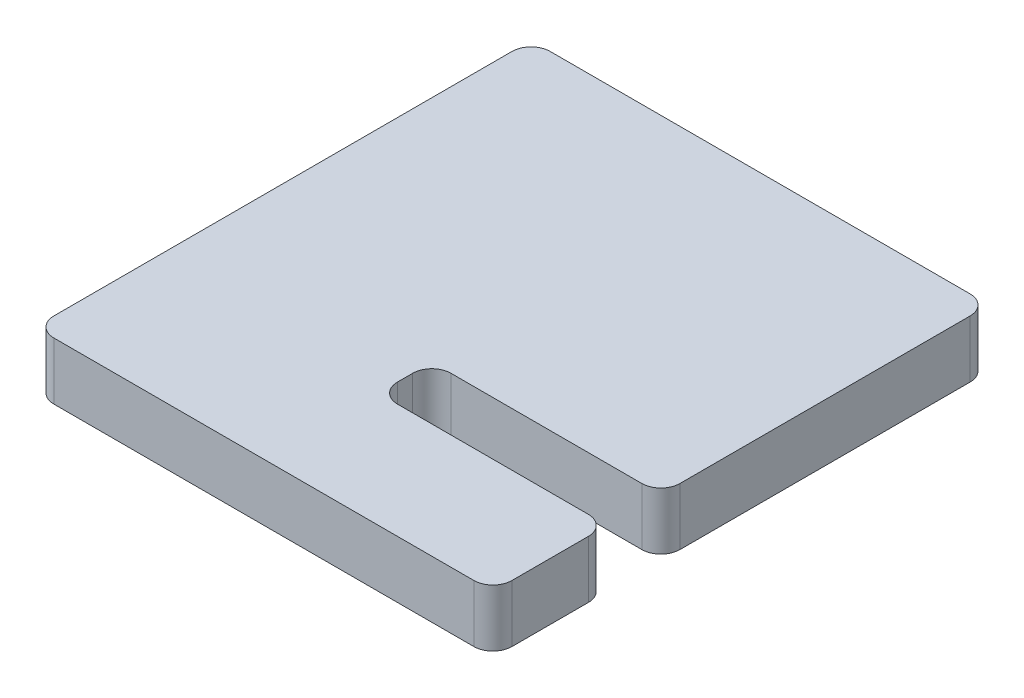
ISO-10303-21;
HEADER;
FILE_DESCRIPTION(('STEP AP214'),'2;1');
FILE_NAME('part.step','',(''),(''),'','','');
FILE_SCHEMA(('AUTOMOTIVE_DESIGN { 1 0 10303 214 1 1 1 1 }'));
ENDSEC;
DATA;
#1=APPLICATION_CONTEXT('core data for automotive mechanical design processes');
#2=APPLICATION_PROTOCOL_DEFINITION('international standard','automotive_design',2000,#1);
#3=PRODUCT_CONTEXT('',#1,'mechanical');
#4=PRODUCT('Part','Part','',(#3));
#5=PRODUCT_RELATED_PRODUCT_CATEGORY('part','',(#4));
#6=PRODUCT_DEFINITION_FORMATION('','',#4);
#7=PRODUCT_DEFINITION_CONTEXT('part definition',#1,'design');
#8=PRODUCT_DEFINITION('design','',#6,#7);
#9=PRODUCT_DEFINITION_SHAPE('','',#8);
#10=(LENGTH_UNIT() NAMED_UNIT(*) SI_UNIT(.MILLI.,.METRE.));
#11=(NAMED_UNIT(*) PLANE_ANGLE_UNIT() SI_UNIT($,.RADIAN.));
#12=(NAMED_UNIT(*) SI_UNIT($,.STERADIAN.) SOLID_ANGLE_UNIT());
#13=UNCERTAINTY_MEASURE_WITH_UNIT(LENGTH_MEASURE(1.E-05),#10,'distance_accuracy_value','');
#14=(GEOMETRIC_REPRESENTATION_CONTEXT(3) GLOBAL_UNCERTAINTY_ASSIGNED_CONTEXT((#13)) GLOBAL_UNIT_ASSIGNED_CONTEXT((#10,
#11,#12)) REPRESENTATION_CONTEXT('',''));
#15=CARTESIAN_POINT('',(0.,0.,0.));
#16=DIRECTION('',(0.,0.,1.));
#17=DIRECTION('',(1.,0.,0.));
#18=AXIS2_PLACEMENT_3D('',#15,#16,#17);
#19=CARTESIAN_POINT('',(-12.,3.,-13.));
#20=DIRECTION('',(1.,0.,0.));
#21=DIRECTION('',(0.,0.,-1.));
#22=AXIS2_PLACEMENT_3D('',#19,#20,#21);
#23=PLANE('',#22);
#24=DIRECTION('',(0.,0.,1.));
#25=VECTOR('',#24,1.);
#26=CARTESIAN_POINT('',(-12.,3.,-13.));
#27=LINE('',#26,#25);
#28=CARTESIAN_POINT('',(-12.,3.,-12.));
#29=VERTEX_POINT('',#28);
#30=CARTESIAN_POINT('',(-12.,3.,12.));
#31=VERTEX_POINT('',#30);
#32=EDGE_CURVE('E166',#29,#31,#27,.T.);
#33=ORIENTED_EDGE('',*,*,#32,.F.);
#34=DIRECTION('',(0.,-1.,0.));
#35=VECTOR('',#34,1.);
#36=CARTESIAN_POINT('',(-12.,3.,-12.));
#37=LINE('',#36,#35);
#38=CARTESIAN_POINT('',(-12.,0.,-12.));
#39=VERTEX_POINT('',#38);
#40=EDGE_CURVE('E151',#29,#39,#37,.T.);
#41=ORIENTED_EDGE('',*,*,#40,.T.);
#42=DIRECTION('',(0.,0.,1.));
#43=VECTOR('',#42,1.);
#44=CARTESIAN_POINT('',(-12.,0.,-13.));
#45=LINE('',#44,#43);
#46=CARTESIAN_POINT('',(-12.,0.,12.));
#47=VERTEX_POINT('',#46);
#48=EDGE_CURVE('E163',#39,#47,#45,.T.);
#49=ORIENTED_EDGE('',*,*,#48,.T.);
#50=DIRECTION('',(0.,-1.,0.));
#51=VECTOR('',#50,1.);
#52=CARTESIAN_POINT('',(-12.,3.,12.));
#53=LINE('',#52,#51);
#54=EDGE_CURVE('E168',#47,#31,#53,.F.);
#55=ORIENTED_EDGE('',*,*,#54,.T.);
#56=EDGE_LOOP('',(#33,#41,#49,#55));
#57=FACE_BOUND('',#56,.T.);
#58=ADVANCED_FACE('F33',(#57),#23,.F.);
#59=CARTESIAN_POINT('',(12.,3.,13.));
#60=DIRECTION('',(0.,0.,-1.));
#61=DIRECTION('',(-1.,0.,0.));
#62=AXIS2_PLACEMENT_3D('',#59,#60,#61);
#63=PLANE('',#62);
#64=DIRECTION('',(1.,0.,0.));
#65=VECTOR('',#64,1.);
#66=CARTESIAN_POINT('',(12.,3.,13.));
#67=LINE('',#66,#65);
#68=CARTESIAN_POINT('',(-11.,3.,13.));
#69=VERTEX_POINT('',#68);
#70=CARTESIAN_POINT('',(11.,3.,13.));
#71=VERTEX_POINT('',#70);
#72=EDGE_CURVE('E380',#69,#71,#67,.T.);
#73=ORIENTED_EDGE('',*,*,#72,.F.);
#74=DIRECTION('',(0.,-1.,0.));
#75=VECTOR('',#74,1.);
#76=CARTESIAN_POINT('',(-11.,3.,13.));
#77=LINE('',#76,#75);
#78=CARTESIAN_POINT('',(-11.,0.,13.));
#79=VERTEX_POINT('',#78);
#80=EDGE_CURVE('E245',#69,#79,#77,.T.);
#81=ORIENTED_EDGE('',*,*,#80,.T.);
#82=DIRECTION('',(1.,0.,0.));
#83=VECTOR('',#82,1.);
#84=CARTESIAN_POINT('',(12.,0.,13.));
#85=LINE('',#84,#83);
#86=CARTESIAN_POINT('',(11.,0.,13.));
#87=VERTEX_POINT('',#86);
#88=EDGE_CURVE('E173',#79,#87,#85,.T.);
#89=ORIENTED_EDGE('',*,*,#88,.T.);
#90=DIRECTION('',(0.,-1.,0.));
#91=VECTOR('',#90,1.);
#92=CARTESIAN_POINT('',(11.,3.,13.));
#93=LINE('',#92,#91);
#94=EDGE_CURVE('E243',#87,#71,#93,.F.);
#95=ORIENTED_EDGE('',*,*,#94,.T.);
#96=EDGE_LOOP('',(#73,#81,#89,#95));
#97=FACE_BOUND('',#96,.T.);
#98=ADVANCED_FACE('F310',(#97),#63,.F.);
#99=CARTESIAN_POINT('',(12.,3.,7.));
#100=DIRECTION('',(-1.,0.,0.));
#101=DIRECTION('',(0.,0.,1.));
#102=AXIS2_PLACEMENT_3D('',#99,#100,#101);
#103=PLANE('',#102);
#104=DIRECTION('',(0.,0.,-1.));
#105=VECTOR('',#104,1.);
#106=CARTESIAN_POINT('',(12.,0.,7.));
#107=LINE('',#106,#105);
#108=CARTESIAN_POINT('',(12.,0.,12.));
#109=VERTEX_POINT('',#108);
#110=CARTESIAN_POINT('',(12.,0.,8.));
#111=VERTEX_POINT('',#110);
#112=EDGE_CURVE('E176',#109,#111,#107,.T.);
#113=ORIENTED_EDGE('',*,*,#112,.T.);
#114=DIRECTION('',(0.,-1.,0.));
#115=VECTOR('',#114,1.);
#116=CARTESIAN_POINT('',(12.,3.,8.));
#117=LINE('',#116,#115);
#118=CARTESIAN_POINT('',(12.,3.,8.));
#119=VERTEX_POINT('',#118);
#120=EDGE_CURVE('E241',#111,#119,#117,.F.);
#121=ORIENTED_EDGE('',*,*,#120,.T.);
#122=DIRECTION('',(0.,0.,-1.));
#123=VECTOR('',#122,1.);
#124=CARTESIAN_POINT('',(12.,3.,7.));
#125=LINE('',#124,#123);
#126=CARTESIAN_POINT('',(12.,3.,12.));
#127=VERTEX_POINT('',#126);
#128=EDGE_CURVE('E277',#127,#119,#125,.T.);
#129=ORIENTED_EDGE('',*,*,#128,.F.);
#130=DIRECTION('',(0.,-1.,0.));
#131=VECTOR('',#130,1.);
#132=CARTESIAN_POINT('',(12.,3.,12.));
#133=LINE('',#132,#131);
#134=EDGE_CURVE('E238',#127,#109,#133,.T.);
#135=ORIENTED_EDGE('',*,*,#134,.T.);
#136=EDGE_LOOP('',(#113,#121,#129,#135));
#137=FACE_BOUND('',#136,.T.);
#138=ADVANCED_FACE('F315',(#137),#103,.F.);
#139=CARTESIAN_POINT('',(0.,3.,7.));
#140=DIRECTION('',(0.,0.,1.));
#141=DIRECTION('',(1.,0.,0.));
#142=AXIS2_PLACEMENT_3D('',#139,#140,#141);
#143=PLANE('',#142);
#144=DIRECTION('',(-1.,0.,0.));
#145=VECTOR('',#144,1.);
#146=CARTESIAN_POINT('',(0.,0.,7.));
#147=LINE('',#146,#145);
#148=CARTESIAN_POINT('',(11.,0.,7.));
#149=VERTEX_POINT('',#148);
#150=CARTESIAN_POINT('',(1.,0.,7.));
#151=VERTEX_POINT('',#150);
#152=EDGE_CURVE('E184',#149,#151,#147,.T.);
#153=ORIENTED_EDGE('',*,*,#152,.T.);
#154=DIRECTION('',(0.,-1.,0.));
#155=VECTOR('',#154,1.);
#156=CARTESIAN_POINT('',(1.,3.,7.));
#157=LINE('',#156,#155);
#158=CARTESIAN_POINT('',(1.,3.,7.));
#159=VERTEX_POINT('',#158);
#160=EDGE_CURVE('E236',#151,#159,#157,.F.);
#161=ORIENTED_EDGE('',*,*,#160,.T.);
#162=DIRECTION('',(-1.,0.,0.));
#163=VECTOR('',#162,1.);
#164=CARTESIAN_POINT('',(0.,3.,7.));
#165=LINE('',#164,#163);
#166=CARTESIAN_POINT('',(11.,3.,7.));
#167=VERTEX_POINT('',#166);
#168=EDGE_CURVE('E269',#167,#159,#165,.T.);
#169=ORIENTED_EDGE('',*,*,#168,.F.);
#170=DIRECTION('',(0.,-1.,0.));
#171=VECTOR('',#170,1.);
#172=CARTESIAN_POINT('',(11.,3.,7.));
#173=LINE('',#172,#171);
#174=EDGE_CURVE('E233',#167,#149,#173,.T.);
#175=ORIENTED_EDGE('',*,*,#174,.T.);
#176=EDGE_LOOP('',(#153,#161,#169,#175));
#177=FACE_BOUND('',#176,.T.);
#178=ADVANCED_FACE('F257',(#177),#143,.F.);
#179=CARTESIAN_POINT('',(0.,3.,7.));
#180=DIRECTION('',(-1.,0.,0.));
#181=DIRECTION('',(0.,0.,1.));
#182=AXIS2_PLACEMENT_3D('',#179,#180,#181);
#183=PLANE('',#182);
#184=DIRECTION('',(0.,0.,-1.));
#185=VECTOR('',#184,1.);
#186=CARTESIAN_POINT('',(0.,0.,7.));
#187=LINE('',#186,#185);
#188=CARTESIAN_POINT('',(0.,0.,6.));
#189=VERTEX_POINT('',#188);
#190=CARTESIAN_POINT('',(0.,0.,5.2));
#191=VERTEX_POINT('',#190);
#192=EDGE_CURVE('E187',#189,#191,#187,.T.);
#193=ORIENTED_EDGE('',*,*,#192,.T.);
#194=DIRECTION('',(0.,-1.,0.));
#195=VECTOR('',#194,1.);
#196=CARTESIAN_POINT('',(0.,3.,5.2));
#197=LINE('',#196,#195);
#198=CARTESIAN_POINT('',(0.,3.,5.2));
#199=VERTEX_POINT('',#198);
#200=EDGE_CURVE('E231',#191,#199,#197,.F.);
#201=ORIENTED_EDGE('',*,*,#200,.T.);
#202=DIRECTION('',(0.,0.,-1.));
#203=VECTOR('',#202,1.);
#204=CARTESIAN_POINT('',(0.,3.,7.));
#205=LINE('',#204,#203);
#206=CARTESIAN_POINT('',(0.,3.,6.));
#207=VERTEX_POINT('',#206);
#208=EDGE_CURVE('E267',#207,#199,#205,.T.);
#209=ORIENTED_EDGE('',*,*,#208,.F.);
#210=DIRECTION('',(0.,-1.,0.));
#211=VECTOR('',#210,1.);
#212=CARTESIAN_POINT('',(0.,0.,6.));
#213=LINE('',#212,#211);
#214=EDGE_CURVE('E228',#207,#189,#213,.T.);
#215=ORIENTED_EDGE('',*,*,#214,.T.);
#216=EDGE_LOOP('',(#193,#201,#209,#215));
#217=FACE_BOUND('',#216,.T.);
#218=ADVANCED_FACE('F271',(#217),#183,.F.);
#219=CARTESIAN_POINT('',(0.,3.,4.2));
#220=DIRECTION('',(0.,0.,-1.));
#221=DIRECTION('',(-1.,0.,0.));
#222=AXIS2_PLACEMENT_3D('',#219,#220,#221);
#223=PLANE('',#222);
#224=DIRECTION('',(1.,0.,0.));
#225=VECTOR('',#224,1.);
#226=CARTESIAN_POINT('',(0.,0.,4.2));
#227=LINE('',#226,#225);
#228=CARTESIAN_POINT('',(1.,0.,4.2));
#229=VERTEX_POINT('',#228);
#230=CARTESIAN_POINT('',(11.,0.,4.2));
#231=VERTEX_POINT('',#230);
#232=EDGE_CURVE('E190',#229,#231,#227,.T.);
#233=ORIENTED_EDGE('',*,*,#232,.T.);
#234=DIRECTION('',(0.,-1.,0.));
#235=VECTOR('',#234,1.);
#236=CARTESIAN_POINT('',(11.,3.,4.2));
#237=LINE('',#236,#235);
#238=CARTESIAN_POINT('',(11.,3.,4.2));
#239=VERTEX_POINT('',#238);
#240=EDGE_CURVE('E226',#231,#239,#237,.F.);
#241=ORIENTED_EDGE('',*,*,#240,.T.);
#242=DIRECTION('',(1.,0.,0.));
#243=VECTOR('',#242,1.);
#244=CARTESIAN_POINT('',(0.,3.,4.2));
#245=LINE('',#244,#243);
#246=CARTESIAN_POINT('',(1.,3.,4.2));
#247=VERTEX_POINT('',#246);
#248=EDGE_CURVE('E273',#247,#239,#245,.T.);
#249=ORIENTED_EDGE('',*,*,#248,.F.);
#250=DIRECTION('',(0.,-1.,0.));
#251=VECTOR('',#250,1.);
#252=CARTESIAN_POINT('',(1.,0.,4.2));
#253=LINE('',#252,#251);
#254=EDGE_CURVE('E223',#247,#229,#253,.T.);
#255=ORIENTED_EDGE('',*,*,#254,.T.);
#256=EDGE_LOOP('',(#233,#241,#249,#255));
#257=FACE_BOUND('',#256,.T.);
#258=ADVANCED_FACE('F295',(#257),#223,.F.);
#259=CARTESIAN_POINT('',(12.,3.,-13.));
#260=DIRECTION('',(-1.,0.,0.));
#261=DIRECTION('',(0.,0.,1.));
#262=AXIS2_PLACEMENT_3D('',#259,#260,#261);
#263=PLANE('',#262);
#264=DIRECTION('',(0.,0.,-1.));
#265=VECTOR('',#264,1.);
#266=CARTESIAN_POINT('',(12.,0.,-13.));
#267=LINE('',#266,#265);
#268=CARTESIAN_POINT('',(12.,0.,3.19999999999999));
#269=VERTEX_POINT('',#268);
#270=CARTESIAN_POINT('',(12.,0.,-12.));
#271=VERTEX_POINT('',#270);
#272=EDGE_CURVE('E193',#269,#271,#267,.T.);
#273=ORIENTED_EDGE('',*,*,#272,.T.);
#274=DIRECTION('',(0.,-1.,0.));
#275=VECTOR('',#274,1.);
#276=CARTESIAN_POINT('',(12.,3.,-12.));
#277=LINE('',#276,#275);
#278=CARTESIAN_POINT('',(12.,3.,-12.));
#279=VERTEX_POINT('',#278);
#280=EDGE_CURVE('E48',#271,#279,#277,.F.);
#281=ORIENTED_EDGE('',*,*,#280,.T.);
#282=DIRECTION('',(0.,0.,-1.));
#283=VECTOR('',#282,1.);
#284=CARTESIAN_POINT('',(12.,3.,-13.));
#285=LINE('',#284,#283);
#286=CARTESIAN_POINT('',(12.,3.,3.19999999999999));
#287=VERTEX_POINT('',#286);
#288=EDGE_CURVE('E275',#287,#279,#285,.T.);
#289=ORIENTED_EDGE('',*,*,#288,.F.);
#290=DIRECTION('',(0.,-1.,0.));
#291=VECTOR('',#290,1.);
#292=CARTESIAN_POINT('',(12.,3.,3.2));
#293=LINE('',#292,#291);
#294=EDGE_CURVE('E219',#287,#269,#293,.T.);
#295=ORIENTED_EDGE('',*,*,#294,.T.);
#296=EDGE_LOOP('',(#273,#281,#289,#295));
#297=FACE_BOUND('',#296,.T.);
#298=ADVANCED_FACE('F288',(#297),#263,.F.);
#299=CARTESIAN_POINT('',(12.,3.,-13.));
#300=DIRECTION('',(0.,0.,1.));
#301=DIRECTION('',(1.,0.,0.));
#302=AXIS2_PLACEMENT_3D('',#299,#300,#301);
#303=PLANE('',#302);
#304=DIRECTION('',(-1.,0.,0.));
#305=VECTOR('',#304,1.);
#306=CARTESIAN_POINT('',(12.,0.,-13.));
#307=LINE('',#306,#305);
#308=CARTESIAN_POINT('',(11.,0.,-13.));
#309=VERTEX_POINT('',#308);
#310=CARTESIAN_POINT('',(-11.,0.,-13.));
#311=VERTEX_POINT('',#310);
#312=EDGE_CURVE('E195',#309,#311,#307,.T.);
#313=ORIENTED_EDGE('',*,*,#312,.T.);
#314=DIRECTION('',(0.,-1.,0.));
#315=VECTOR('',#314,1.);
#316=CARTESIAN_POINT('',(-11.,3.,-13.));
#317=LINE('',#316,#315);
#318=CARTESIAN_POINT('',(-11.,3.,-13.));
#319=VERTEX_POINT('',#318);
#320=EDGE_CURVE('E152',#311,#319,#317,.F.);
#321=ORIENTED_EDGE('',*,*,#320,.T.);
#322=DIRECTION('',(-1.,0.,0.));
#323=VECTOR('',#322,1.);
#324=CARTESIAN_POINT('',(12.,3.,-13.));
#325=LINE('',#324,#323);
#326=CARTESIAN_POINT('',(11.,3.,-13.));
#327=VERTEX_POINT('',#326);
#328=EDGE_CURVE('E179',#327,#319,#325,.T.);
#329=ORIENTED_EDGE('',*,*,#328,.F.);
#330=DIRECTION('',(0.,-1.,0.));
#331=VECTOR('',#330,1.);
#332=CARTESIAN_POINT('',(11.,3.,-13.));
#333=LINE('',#332,#331);
#334=EDGE_CURVE('E157',#327,#309,#333,.T.);
#335=ORIENTED_EDGE('',*,*,#334,.T.);
#336=EDGE_LOOP('',(#313,#321,#329,#335));
#337=FACE_BOUND('',#336,.T.);
#338=ADVANCED_FACE('F284',(#337),#303,.F.);
#339=CARTESIAN_POINT('',(0.,3.,0.));
#340=DIRECTION('',(0.,-1.,0.));
#341=DIRECTION('',(0.,0.,-1.));
#342=AXIS2_PLACEMENT_3D('',#339,#340,#341);
#343=PLANE('',#342);
#344=ORIENTED_EDGE('',*,*,#328,.T.);
#345=CARTESIAN_POINT('',(-11.,3.,-12.));
#346=DIRECTION('',(0.,-1.,0.));
#347=DIRECTION('',(0.,0.,-1.));
#348=AXIS2_PLACEMENT_3D('',#345,#346,#347);
#349=CIRCLE('',#348,1.);
#350=EDGE_CURVE('E217',#319,#29,#349,.F.);
#351=ORIENTED_EDGE('',*,*,#350,.T.);
#352=ORIENTED_EDGE('',*,*,#32,.T.);
#353=CARTESIAN_POINT('',(-11.,3.,12.));
#354=DIRECTION('',(0.,-1.,0.));
#355=DIRECTION('',(0.,0.,-1.));
#356=AXIS2_PLACEMENT_3D('',#353,#354,#355);
#357=CIRCLE('',#356,1.);
#358=EDGE_CURVE('E210',#31,#69,#357,.F.);
#359=ORIENTED_EDGE('',*,*,#358,.T.);
#360=ORIENTED_EDGE('',*,*,#72,.T.);
#361=CARTESIAN_POINT('',(11.,3.,12.));
#362=DIRECTION('',(0.,-1.,0.));
#363=DIRECTION('',(0.,0.,-1.));
#364=AXIS2_PLACEMENT_3D('',#361,#362,#363);
#365=CIRCLE('',#364,1.);
#366=EDGE_CURVE('E208',#71,#127,#365,.F.);
#367=ORIENTED_EDGE('',*,*,#366,.T.);
#368=ORIENTED_EDGE('',*,*,#128,.T.);
#369=CARTESIAN_POINT('',(11.,3.,8.));
#370=DIRECTION('',(0.,-1.,0.));
#371=DIRECTION('',(0.,0.,-1.));
#372=AXIS2_PLACEMENT_3D('',#369,#370,#371);
#373=CIRCLE('',#372,1.);
#374=EDGE_CURVE('E212',#119,#167,#373,.F.);
#375=ORIENTED_EDGE('',*,*,#374,.T.);
#376=ORIENTED_EDGE('',*,*,#168,.T.);
#377=CARTESIAN_POINT('',(1.,3.,6.));
#378=DIRECTION('',(0.,-1.,0.));
#379=DIRECTION('',(0.,0.,-1.));
#380=AXIS2_PLACEMENT_3D('',#377,#378,#379);
#381=CIRCLE('',#380,1.);
#382=EDGE_CURVE('E11',#159,#207,#381,.T.);
#383=ORIENTED_EDGE('',*,*,#382,.T.);
#384=ORIENTED_EDGE('',*,*,#208,.T.);
#385=CARTESIAN_POINT('',(1.,3.,5.2));
#386=DIRECTION('',(0.,-1.,0.));
#387=DIRECTION('',(0.,0.,-1.));
#388=AXIS2_PLACEMENT_3D('',#385,#386,#387);
#389=CIRCLE('',#388,1.);
#390=EDGE_CURVE('E250',#199,#247,#389,.T.);
#391=ORIENTED_EDGE('',*,*,#390,.T.);
#392=ORIENTED_EDGE('',*,*,#248,.T.);
#393=CARTESIAN_POINT('',(11.,3.,3.2));
#394=DIRECTION('',(0.,-1.,0.));
#395=DIRECTION('',(0.,0.,-1.));
#396=AXIS2_PLACEMENT_3D('',#393,#394,#395);
#397=CIRCLE('',#396,1.);
#398=EDGE_CURVE('E55',#239,#287,#397,.F.);
#399=ORIENTED_EDGE('',*,*,#398,.T.);
#400=ORIENTED_EDGE('',*,*,#288,.T.);
#401=CARTESIAN_POINT('',(11.,3.,-12.));
#402=DIRECTION('',(0.,-1.,0.));
#403=DIRECTION('',(0.,0.,-1.));
#404=AXIS2_PLACEMENT_3D('',#401,#402,#403);
#405=CIRCLE('',#404,1.);
#406=EDGE_CURVE('E215',#279,#327,#405,.F.);
#407=ORIENTED_EDGE('',*,*,#406,.T.);
#408=EDGE_LOOP('',(#344,#351,#352,#359,#360,#367,#368,#375,#376,#383,#384,#391,#392,#399,#400,#407));
#409=FACE_BOUND('',#408,.T.);
#410=ADVANCED_FACE('F266',(#409),#343,.F.);
#411=CARTESIAN_POINT('',(0.,0.,0.));
#412=DIRECTION('',(0.,-1.,0.));
#413=DIRECTION('',(0.,0.,-1.));
#414=AXIS2_PLACEMENT_3D('',#411,#412,#413);
#415=PLANE('',#414);
#416=ORIENTED_EDGE('',*,*,#48,.F.);
#417=CARTESIAN_POINT('',(-11.,0.,-12.));
#418=DIRECTION('',(0.,-1.,0.));
#419=DIRECTION('',(0.,0.,-1.));
#420=AXIS2_PLACEMENT_3D('',#417,#418,#419);
#421=CIRCLE('',#420,1.);
#422=EDGE_CURVE('E147',#39,#311,#421,.T.);
#423=ORIENTED_EDGE('',*,*,#422,.T.);
#424=ORIENTED_EDGE('',*,*,#312,.F.);
#425=CARTESIAN_POINT('',(11.,0.,-12.));
#426=DIRECTION('',(0.,-1.,0.));
#427=DIRECTION('',(0.,0.,-1.));
#428=AXIS2_PLACEMENT_3D('',#425,#426,#427);
#429=CIRCLE('',#428,1.);
#430=EDGE_CURVE('E158',#309,#271,#429,.T.);
#431=ORIENTED_EDGE('',*,*,#430,.T.);
#432=ORIENTED_EDGE('',*,*,#272,.F.);
#433=CARTESIAN_POINT('',(11.,0.,3.2));
#434=DIRECTION('',(0.,-1.,0.));
#435=DIRECTION('',(0.,0.,-1.));
#436=AXIS2_PLACEMENT_3D('',#433,#434,#435);
#437=CIRCLE('',#436,1.);
#438=EDGE_CURVE('E202',#269,#231,#437,.T.);
#439=ORIENTED_EDGE('',*,*,#438,.T.);
#440=ORIENTED_EDGE('',*,*,#232,.F.);
#441=CARTESIAN_POINT('',(1.,0.,5.2));
#442=DIRECTION('',(0.,-1.,0.));
#443=DIRECTION('',(0.,0.,-1.));
#444=AXIS2_PLACEMENT_3D('',#441,#442,#443);
#445=CIRCLE('',#444,1.);
#446=EDGE_CURVE('E248',#229,#191,#445,.F.);
#447=ORIENTED_EDGE('',*,*,#446,.T.);
#448=ORIENTED_EDGE('',*,*,#192,.F.);
#449=CARTESIAN_POINT('',(1.,0.,6.));
#450=DIRECTION('',(0.,-1.,0.));
#451=DIRECTION('',(0.,0.,-1.));
#452=AXIS2_PLACEMENT_3D('',#449,#450,#451);
#453=CIRCLE('',#452,1.);
#454=EDGE_CURVE('E41',#189,#151,#453,.F.);
#455=ORIENTED_EDGE('',*,*,#454,.T.);
#456=ORIENTED_EDGE('',*,*,#152,.F.);
#457=CARTESIAN_POINT('',(11.,0.,8.));
#458=DIRECTION('',(0.,-1.,0.));
#459=DIRECTION('',(0.,0.,-1.));
#460=AXIS2_PLACEMENT_3D('',#457,#458,#459);
#461=CIRCLE('',#460,1.);
#462=EDGE_CURVE('E200',#149,#111,#461,.T.);
#463=ORIENTED_EDGE('',*,*,#462,.T.);
#464=ORIENTED_EDGE('',*,*,#112,.F.);
#465=CARTESIAN_POINT('',(11.,0.,12.));
#466=DIRECTION('',(0.,-1.,0.));
#467=DIRECTION('',(0.,0.,-1.));
#468=AXIS2_PLACEMENT_3D('',#465,#466,#467);
#469=CIRCLE('',#468,1.);
#470=EDGE_CURVE('E167',#109,#87,#469,.T.);
#471=ORIENTED_EDGE('',*,*,#470,.T.);
#472=ORIENTED_EDGE('',*,*,#88,.F.);
#473=CARTESIAN_POINT('',(-11.,0.,12.));
#474=DIRECTION('',(0.,-1.,0.));
#475=DIRECTION('',(0.,0.,-1.));
#476=AXIS2_PLACEMENT_3D('',#473,#474,#475);
#477=CIRCLE('',#476,1.);
#478=EDGE_CURVE('E172',#79,#47,#477,.T.);
#479=ORIENTED_EDGE('',*,*,#478,.T.);
#480=EDGE_LOOP('',(#416,#423,#424,#431,#432,#439,#440,#447,#448,#455,#456,#463,#464,#471,#472,#479));
#481=FACE_BOUND('',#480,.T.);
#482=ADVANCED_FACE('F170',(#481),#415,.T.);
#483=CARTESIAN_POINT('',(-11.,3.,-12.));
#484=DIRECTION('',(0.,-1.,0.));
#485=DIRECTION('',(0.,0.,-1.));
#486=AXIS2_PLACEMENT_3D('',#483,#484,#485);
#487=CYLINDRICAL_SURFACE('',#486,1.);
#488=ORIENTED_EDGE('',*,*,#350,.F.);
#489=ORIENTED_EDGE('',*,*,#320,.F.);
#490=ORIENTED_EDGE('',*,*,#422,.F.);
#491=ORIENTED_EDGE('',*,*,#40,.F.);
#492=EDGE_LOOP('',(#488,#489,#490,#491));
#493=FACE_BOUND('',#492,.T.);
#494=ADVANCED_FACE('F150',(#493),#487,.T.);
#495=CARTESIAN_POINT('',(11.,3.,-12.));
#496=DIRECTION('',(0.,-1.,0.));
#497=DIRECTION('',(0.,0.,-1.));
#498=AXIS2_PLACEMENT_3D('',#495,#496,#497);
#499=CYLINDRICAL_SURFACE('',#498,1.);
#500=ORIENTED_EDGE('',*,*,#406,.F.);
#501=ORIENTED_EDGE('',*,*,#280,.F.);
#502=ORIENTED_EDGE('',*,*,#430,.F.);
#503=ORIENTED_EDGE('',*,*,#334,.F.);
#504=EDGE_LOOP('',(#500,#501,#502,#503));
#505=FACE_BOUND('',#504,.T.);
#506=ADVANCED_FACE('F286',(#505),#499,.T.);
#507=CARTESIAN_POINT('',(11.,3.,3.2));
#508=DIRECTION('',(0.,-1.,0.));
#509=DIRECTION('',(0.,0.,-1.));
#510=AXIS2_PLACEMENT_3D('',#507,#508,#509);
#511=CYLINDRICAL_SURFACE('',#510,1.);
#512=ORIENTED_EDGE('',*,*,#398,.F.);
#513=ORIENTED_EDGE('',*,*,#240,.F.);
#514=ORIENTED_EDGE('',*,*,#438,.F.);
#515=ORIENTED_EDGE('',*,*,#294,.F.);
#516=EDGE_LOOP('',(#512,#513,#514,#515));
#517=FACE_BOUND('',#516,.T.);
#518=ADVANCED_FACE('F291',(#517),#511,.T.);
#519=CARTESIAN_POINT('',(1.,3.,5.2));
#520=DIRECTION('',(0.,1.,0.));
#521=DIRECTION('',(0.,0.,1.));
#522=AXIS2_PLACEMENT_3D('',#519,#520,#521);
#523=CYLINDRICAL_SURFACE('',#522,1.);
#524=ORIENTED_EDGE('',*,*,#390,.F.);
#525=ORIENTED_EDGE('',*,*,#200,.F.);
#526=ORIENTED_EDGE('',*,*,#446,.F.);
#527=ORIENTED_EDGE('',*,*,#254,.F.);
#528=EDGE_LOOP('',(#524,#525,#526,#527));
#529=FACE_BOUND('',#528,.T.);
#530=ADVANCED_FACE('F299',(#529),#523,.F.);
#531=CARTESIAN_POINT('',(1.,3.,6.));
#532=DIRECTION('',(0.,1.,0.));
#533=DIRECTION('',(0.,0.,1.));
#534=AXIS2_PLACEMENT_3D('',#531,#532,#533);
#535=CYLINDRICAL_SURFACE('',#534,1.);
#536=ORIENTED_EDGE('',*,*,#382,.F.);
#537=ORIENTED_EDGE('',*,*,#160,.F.);
#538=ORIENTED_EDGE('',*,*,#454,.F.);
#539=ORIENTED_EDGE('',*,*,#214,.F.);
#540=EDGE_LOOP('',(#536,#537,#538,#539));
#541=FACE_BOUND('',#540,.T.);
#542=ADVANCED_FACE('F262',(#541),#535,.F.);
#543=CARTESIAN_POINT('',(11.,3.,8.));
#544=DIRECTION('',(0.,-1.,0.));
#545=DIRECTION('',(0.,0.,-1.));
#546=AXIS2_PLACEMENT_3D('',#543,#544,#545);
#547=CYLINDRICAL_SURFACE('',#546,1.);
#548=ORIENTED_EDGE('',*,*,#374,.F.);
#549=ORIENTED_EDGE('',*,*,#120,.F.);
#550=ORIENTED_EDGE('',*,*,#462,.F.);
#551=ORIENTED_EDGE('',*,*,#174,.F.);
#552=EDGE_LOOP('',(#548,#549,#550,#551));
#553=FACE_BOUND('',#552,.T.);
#554=ADVANCED_FACE('F306',(#553),#547,.T.);
#555=CARTESIAN_POINT('',(-11.,3.,12.));
#556=DIRECTION('',(0.,-1.,0.));
#557=DIRECTION('',(0.,0.,-1.));
#558=AXIS2_PLACEMENT_3D('',#555,#556,#557);
#559=CYLINDRICAL_SURFACE('',#558,1.);
#560=ORIENTED_EDGE('',*,*,#358,.F.);
#561=ORIENTED_EDGE('',*,*,#54,.F.);
#562=ORIENTED_EDGE('',*,*,#478,.F.);
#563=ORIENTED_EDGE('',*,*,#80,.F.);
#564=EDGE_LOOP('',(#560,#561,#562,#563));
#565=FACE_BOUND('',#564,.T.);
#566=ADVANCED_FACE('F351',(#565),#559,.T.);
#567=CARTESIAN_POINT('',(11.,3.,12.));
#568=DIRECTION('',(0.,-1.,0.));
#569=DIRECTION('',(0.,0.,-1.));
#570=AXIS2_PLACEMENT_3D('',#567,#568,#569);
#571=CYLINDRICAL_SURFACE('',#570,1.);
#572=ORIENTED_EDGE('',*,*,#366,.F.);
#573=ORIENTED_EDGE('',*,*,#94,.F.);
#574=ORIENTED_EDGE('',*,*,#470,.F.);
#575=ORIENTED_EDGE('',*,*,#134,.F.);
#576=EDGE_LOOP('',(#572,#573,#574,#575));
#577=FACE_BOUND('',#576,.T.);
#578=ADVANCED_FACE('F35',(#577),#571,.T.);
#579=CLOSED_SHELL('',(#58,#98,#138,#178,#218,#258,#298,#338,#410,#482,#494,#506,#518,#530,#542,
#554,#566,#578));
#580=MANIFOLD_SOLID_BREP('B2',#579);
#581=ADVANCED_BREP_SHAPE_REPRESENTATION('',(#18,#580),#14);
#582=SHAPE_DEFINITION_REPRESENTATION(#9,#581);
ENDSEC;
END-ISO-10303-21;
